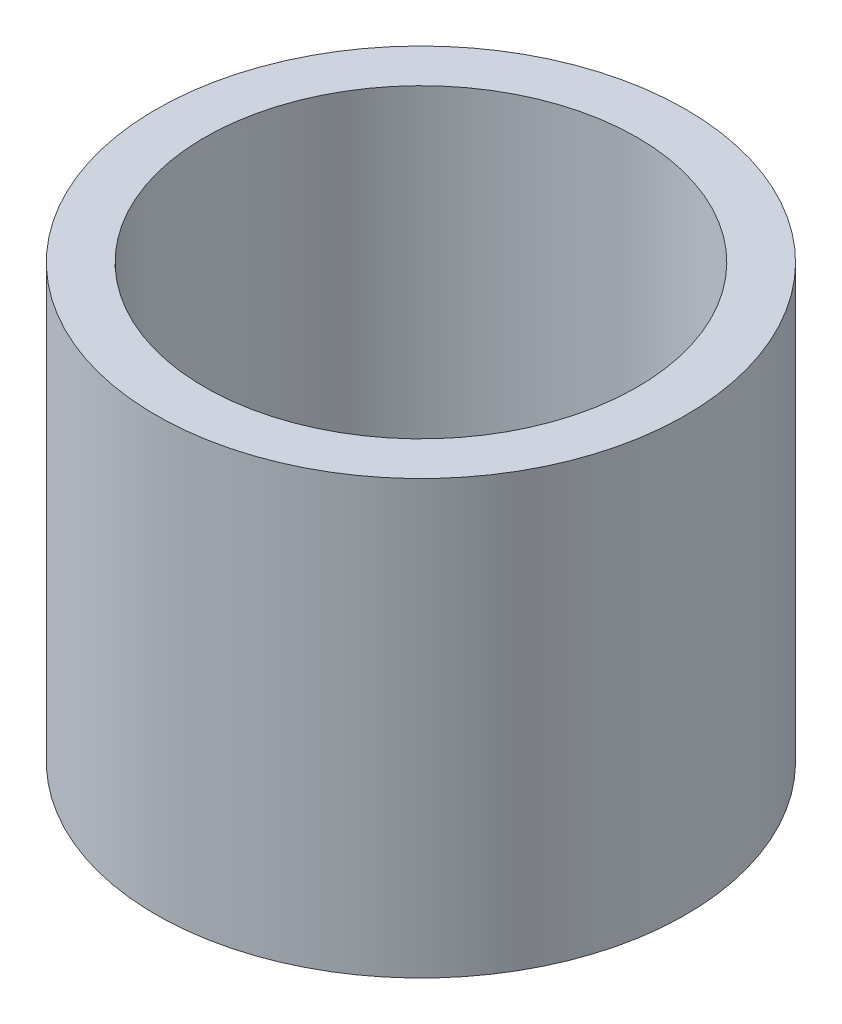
from build123d import *

# Parameters (mm, degrees)
SKETCH4_R           = 34.6075
SKETCH4_R_2         = 28.2575
BOSS_EXTRUDE1_DEPTH = 56.515


with BuildPart() as part:
    # Sketch4 → Boss-Extrude1 (new body)
    with BuildSketch(Plane(origin=(0, 0, 0), x_dir=(1, 0, 0), z_dir=(0, 1, 0))):
        with Locations(Location((0, 0, 0), (0, 0, 90))):
            Circle(SKETCH4_R)
        with Locations(Location((0, 0, 0), (0, 0, 90))):
            Circle(SKETCH4_R_2, mode=Mode.SUBTRACT)
    extrude(amount=BOSS_EXTRUDE1_DEPTH)


solid = part.part
